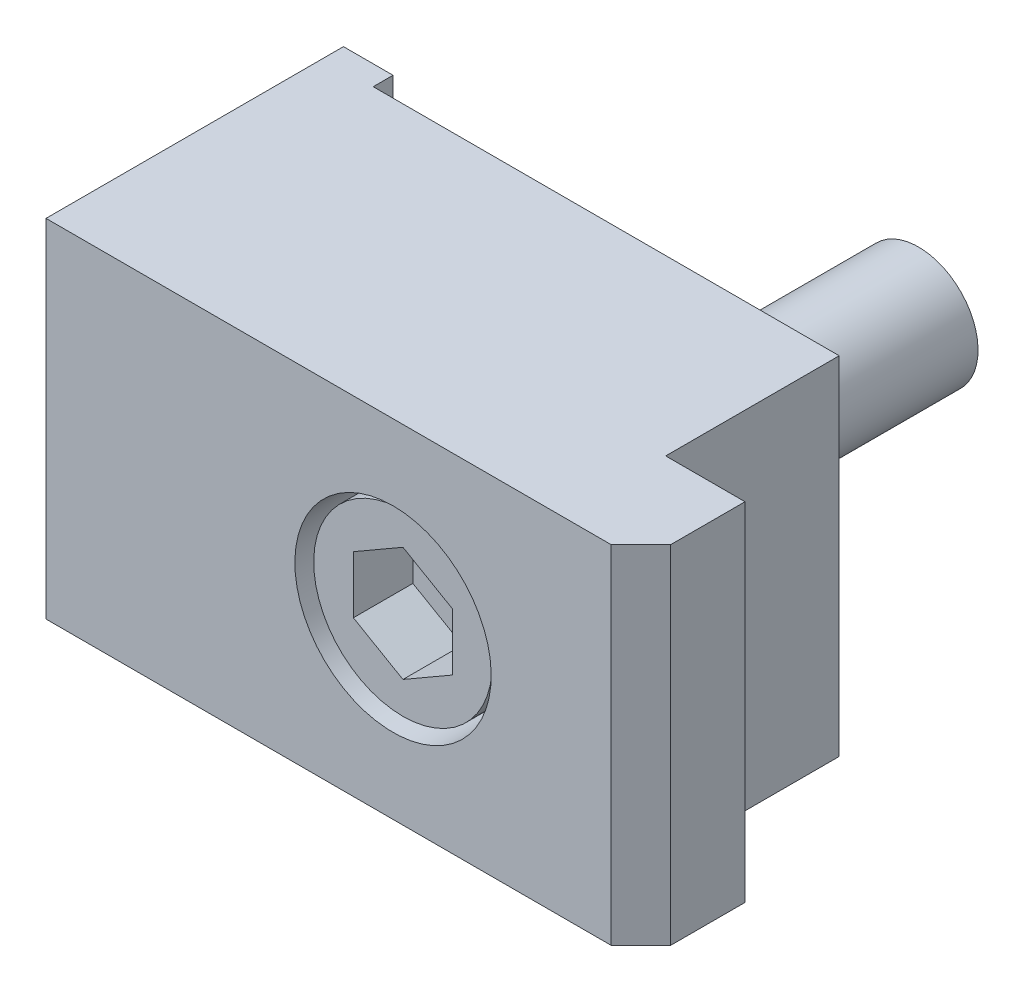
ISO-10303-21;
HEADER;
FILE_DESCRIPTION(('STEP AP214'),'2;1');
FILE_NAME('part.step','',(''),(''),'','','');
FILE_SCHEMA(('AUTOMOTIVE_DESIGN { 1 0 10303 214 1 1 1 1 }'));
ENDSEC;
DATA;
#1=APPLICATION_CONTEXT('core data for automotive mechanical design processes');
#2=APPLICATION_PROTOCOL_DEFINITION('international standard','automotive_design',2000,#1);
#3=PRODUCT_CONTEXT('',#1,'mechanical');
#4=PRODUCT('Part','Part','',(#3));
#5=PRODUCT_RELATED_PRODUCT_CATEGORY('part','',(#4));
#6=PRODUCT_DEFINITION_FORMATION('','',#4);
#7=PRODUCT_DEFINITION_CONTEXT('part definition',#1,'design');
#8=PRODUCT_DEFINITION('design','',#6,#7);
#9=PRODUCT_DEFINITION_SHAPE('','',#8);
#10=(LENGTH_UNIT() NAMED_UNIT(*) SI_UNIT(.MILLI.,.METRE.));
#11=(NAMED_UNIT(*) PLANE_ANGLE_UNIT() SI_UNIT($,.RADIAN.));
#12=(NAMED_UNIT(*) SI_UNIT($,.STERADIAN.) SOLID_ANGLE_UNIT());
#13=UNCERTAINTY_MEASURE_WITH_UNIT(LENGTH_MEASURE(1.E-05),#10,'distance_accuracy_value','');
#14=(GEOMETRIC_REPRESENTATION_CONTEXT(3) GLOBAL_UNCERTAINTY_ASSIGNED_CONTEXT((#13)) GLOBAL_UNIT_ASSIGNED_CONTEXT((#10,
#11,#12)) REPRESENTATION_CONTEXT('',''));
#15=CARTESIAN_POINT('',(0.,0.,0.));
#16=DIRECTION('',(0.,0.,1.));
#17=DIRECTION('',(1.,0.,0.));
#18=AXIS2_PLACEMENT_3D('',#15,#16,#17);
#19=CARTESIAN_POINT('',(-5.,-2.88675134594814,23.));
#20=DIRECTION('',(0.,0.,-1.));
#21=DIRECTION('',(0.,1.,0.));
#22=AXIS2_PLACEMENT_3D('',#19,#20,#21);
#23=PLANE('',#22);
#24=DIRECTION('',(0.866025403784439,-0.5,0.));
#25=VECTOR('',#24,1.);
#26=CARTESIAN_POINT('',(-5.,-2.88675134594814,23.));
#27=LINE('',#26,#25);
#28=CARTESIAN_POINT('',(-5.,-2.88675134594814,23.));
#29=VERTEX_POINT('',#28);
#30=CARTESIAN_POINT('',(0.,-5.77350269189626,23.));
#31=VERTEX_POINT('',#30);
#32=EDGE_CURVE('E260',#29,#31,#27,.T.);
#33=ORIENTED_EDGE('',*,*,#32,.T.);
#34=DIRECTION('',(0.866025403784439,0.5,0.));
#35=VECTOR('',#34,1.);
#36=CARTESIAN_POINT('',(0.,-5.77350269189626,23.));
#37=LINE('',#36,#35);
#38=CARTESIAN_POINT('',(5.,-2.88675134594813,23.));
#39=VERTEX_POINT('',#38);
#40=EDGE_CURVE('E262',#31,#39,#37,.T.);
#41=ORIENTED_EDGE('',*,*,#40,.T.);
#42=DIRECTION('',(0.,1.,0.));
#43=VECTOR('',#42,1.);
#44=CARTESIAN_POINT('',(5.,-2.88675134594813,23.));
#45=LINE('',#44,#43);
#46=CARTESIAN_POINT('',(5.,2.88675134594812,23.));
#47=VERTEX_POINT('',#46);
#48=EDGE_CURVE('E265',#39,#47,#45,.T.);
#49=ORIENTED_EDGE('',*,*,#48,.T.);
#50=DIRECTION('',(-0.866025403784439,0.5,0.));
#51=VECTOR('',#50,1.);
#52=CARTESIAN_POINT('',(5.,2.88675134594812,23.));
#53=LINE('',#52,#51);
#54=CARTESIAN_POINT('',(0.,5.77350269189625,23.));
#55=VERTEX_POINT('',#54);
#56=EDGE_CURVE('E154',#47,#55,#53,.T.);
#57=ORIENTED_EDGE('',*,*,#56,.T.);
#58=DIRECTION('',(-0.866025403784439,-0.5,0.));
#59=VECTOR('',#58,1.);
#60=CARTESIAN_POINT('',(0.,5.77350269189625,23.));
#61=LINE('',#60,#59);
#62=CARTESIAN_POINT('',(-5.,2.88675134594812,23.));
#63=VERTEX_POINT('',#62);
#64=EDGE_CURVE('E137',#55,#63,#61,.T.);
#65=ORIENTED_EDGE('',*,*,#64,.T.);
#66=DIRECTION('',(0.,-1.,0.));
#67=VECTOR('',#66,1.);
#68=CARTESIAN_POINT('',(-5.,2.88675134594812,23.));
#69=LINE('',#68,#67);
#70=EDGE_CURVE('E151',#63,#29,#69,.T.);
#71=ORIENTED_EDGE('',*,*,#70,.T.);
#72=EDGE_LOOP('',(#33,#41,#49,#57,#65,#71));
#73=FACE_BOUND('',#72,.T.);
#74=ADVANCED_FACE('F14',(#73),#23,.F.);
#75=CARTESIAN_POINT('',(0.,-5.77350269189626,23.));
#76=DIRECTION('',(0.5,-0.866025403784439,0.));
#77=DIRECTION('',(0.866025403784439,0.5,0.));
#78=AXIS2_PLACEMENT_3D('',#75,#76,#77);
#79=PLANE('',#78);
#80=DIRECTION('',(0.866025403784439,0.5,0.));
#81=VECTOR('',#80,1.);
#82=CARTESIAN_POINT('',(0.,-5.77350269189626,29.));
#83=LINE('',#82,#81);
#84=CARTESIAN_POINT('',(0.,-5.77350269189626,29.));
#85=VERTEX_POINT('',#84);
#86=CARTESIAN_POINT('',(5.,-2.88675134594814,29.));
#87=VERTEX_POINT('',#86);
#88=EDGE_CURVE('E248',#85,#87,#83,.T.);
#89=ORIENTED_EDGE('',*,*,#88,.T.);
#90=DIRECTION('',(0.,0.,1.));
#91=VECTOR('',#90,1.);
#92=CARTESIAN_POINT('',(5.,-2.88675134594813,23.));
#93=LINE('',#92,#91);
#94=EDGE_CURVE('E108',#39,#87,#93,.T.);
#95=ORIENTED_EDGE('',*,*,#94,.F.);
#96=ORIENTED_EDGE('',*,*,#40,.F.);
#97=DIRECTION('',(0.,0.,1.));
#98=VECTOR('',#97,1.);
#99=CARTESIAN_POINT('',(0.,-5.77350269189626,23.));
#100=LINE('',#99,#98);
#101=EDGE_CURVE('E158',#31,#85,#100,.T.);
#102=ORIENTED_EDGE('',*,*,#101,.T.);
#103=EDGE_LOOP('',(#89,#95,#96,#102));
#104=FACE_BOUND('',#103,.T.);
#105=ADVANCED_FACE('F277',(#104),#79,.F.);
#106=CARTESIAN_POINT('',(5.,-2.88675134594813,23.));
#107=DIRECTION('',(1.,0.,0.));
#108=DIRECTION('',(0.,1.,0.));
#109=AXIS2_PLACEMENT_3D('',#106,#107,#108);
#110=PLANE('',#109);
#111=DIRECTION('',(0.,1.,0.));
#112=VECTOR('',#111,1.);
#113=CARTESIAN_POINT('',(5.,-2.88675134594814,29.));
#114=LINE('',#113,#112);
#115=CARTESIAN_POINT('',(5.,2.88675134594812,29.));
#116=VERTEX_POINT('',#115);
#117=EDGE_CURVE('E250',#87,#116,#114,.T.);
#118=ORIENTED_EDGE('',*,*,#117,.T.);
#119=DIRECTION('',(0.,0.,1.));
#120=VECTOR('',#119,1.);
#121=CARTESIAN_POINT('',(5.,2.88675134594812,23.));
#122=LINE('',#121,#120);
#123=EDGE_CURVE('E166',#47,#116,#122,.T.);
#124=ORIENTED_EDGE('',*,*,#123,.F.);
#125=ORIENTED_EDGE('',*,*,#48,.F.);
#126=ORIENTED_EDGE('',*,*,#94,.T.);
#127=EDGE_LOOP('',(#118,#124,#125,#126));
#128=FACE_BOUND('',#127,.T.);
#129=ADVANCED_FACE('F267',(#128),#110,.F.);
#130=CARTESIAN_POINT('',(5.,2.88675134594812,23.));
#131=DIRECTION('',(0.5,0.866025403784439,0.));
#132=DIRECTION('',(-0.866025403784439,0.5,0.));
#133=AXIS2_PLACEMENT_3D('',#130,#131,#132);
#134=PLANE('',#133);
#135=DIRECTION('',(-0.866025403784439,0.5,0.));
#136=VECTOR('',#135,1.);
#137=CARTESIAN_POINT('',(5.,2.88675134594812,29.));
#138=LINE('',#137,#136);
#139=CARTESIAN_POINT('',(0.,5.77350269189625,29.));
#140=VERTEX_POINT('',#139);
#141=EDGE_CURVE('E254',#116,#140,#138,.T.);
#142=ORIENTED_EDGE('',*,*,#141,.T.);
#143=DIRECTION('',(0.,0.,1.));
#144=VECTOR('',#143,1.);
#145=CARTESIAN_POINT('',(0.,5.77350269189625,23.));
#146=LINE('',#145,#144);
#147=EDGE_CURVE('E146',#55,#140,#146,.T.);
#148=ORIENTED_EDGE('',*,*,#147,.F.);
#149=ORIENTED_EDGE('',*,*,#56,.F.);
#150=ORIENTED_EDGE('',*,*,#123,.T.);
#151=EDGE_LOOP('',(#142,#148,#149,#150));
#152=FACE_BOUND('',#151,.T.);
#153=ADVANCED_FACE('F271',(#152),#134,.F.);
#154=CARTESIAN_POINT('',(0.,5.77350269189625,23.));
#155=DIRECTION('',(-0.5,0.866025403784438,0.));
#156=DIRECTION('',(-0.866025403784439,-0.5,0.));
#157=AXIS2_PLACEMENT_3D('',#154,#155,#156);
#158=PLANE('',#157);
#159=DIRECTION('',(-0.866025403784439,-0.5,0.));
#160=VECTOR('',#159,1.);
#161=CARTESIAN_POINT('',(0.,5.77350269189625,29.));
#162=LINE('',#161,#160);
#163=CARTESIAN_POINT('',(-5.,2.88675134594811,29.));
#164=VERTEX_POINT('',#163);
#165=EDGE_CURVE('E140',#140,#164,#162,.T.);
#166=ORIENTED_EDGE('',*,*,#165,.T.);
#167=DIRECTION('',(0.,0.,1.));
#168=VECTOR('',#167,1.);
#169=CARTESIAN_POINT('',(-5.,2.88675134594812,23.));
#170=LINE('',#169,#168);
#171=EDGE_CURVE('E134',#63,#164,#170,.T.);
#172=ORIENTED_EDGE('',*,*,#171,.F.);
#173=ORIENTED_EDGE('',*,*,#64,.F.);
#174=ORIENTED_EDGE('',*,*,#147,.T.);
#175=EDGE_LOOP('',(#166,#172,#173,#174));
#176=FACE_BOUND('',#175,.T.);
#177=ADVANCED_FACE('F136',(#176),#158,.F.);
#178=CARTESIAN_POINT('',(-5.,2.88675134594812,23.));
#179=DIRECTION('',(-1.,0.,0.));
#180=DIRECTION('',(0.,0.,-1.));
#181=AXIS2_PLACEMENT_3D('',#178,#179,#180);
#182=PLANE('',#181);
#183=DIRECTION('',(0.,-1.,0.));
#184=VECTOR('',#183,1.);
#185=CARTESIAN_POINT('',(-5.,2.88675134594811,29.));
#186=LINE('',#185,#184);
#187=CARTESIAN_POINT('',(-5.,-2.88675134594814,29.));
#188=VERTEX_POINT('',#187);
#189=EDGE_CURVE('E258',#164,#188,#186,.T.);
#190=ORIENTED_EDGE('',*,*,#189,.T.);
#191=DIRECTION('',(0.,0.,1.));
#192=VECTOR('',#191,1.);
#193=CARTESIAN_POINT('',(-5.,-2.88675134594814,23.));
#194=LINE('',#193,#192);
#195=EDGE_CURVE('E145',#29,#188,#194,.T.);
#196=ORIENTED_EDGE('',*,*,#195,.F.);
#197=ORIENTED_EDGE('',*,*,#70,.F.);
#198=ORIENTED_EDGE('',*,*,#171,.T.);
#199=EDGE_LOOP('',(#190,#196,#197,#198));
#200=FACE_BOUND('',#199,.T.);
#201=ADVANCED_FACE('F156',(#200),#182,.F.);
#202=CARTESIAN_POINT('',(-5.,-2.88675134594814,23.));
#203=DIRECTION('',(-0.5,-0.866025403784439,0.));
#204=DIRECTION('',(0.866025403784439,-0.5,0.));
#205=AXIS2_PLACEMENT_3D('',#202,#203,#204);
#206=PLANE('',#205);
#207=DIRECTION('',(0.866025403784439,-0.5,0.));
#208=VECTOR('',#207,1.);
#209=CARTESIAN_POINT('',(-5.,-2.88675134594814,29.));
#210=LINE('',#209,#208);
#211=EDGE_CURVE('E33',#188,#85,#210,.T.);
#212=ORIENTED_EDGE('',*,*,#211,.T.);
#213=ORIENTED_EDGE('',*,*,#101,.F.);
#214=ORIENTED_EDGE('',*,*,#32,.F.);
#215=ORIENTED_EDGE('',*,*,#195,.T.);
#216=EDGE_LOOP('',(#212,#213,#214,#215));
#217=FACE_BOUND('',#216,.T.);
#218=ADVANCED_FACE('F278',(#217),#206,.F.);
#219=CARTESIAN_POINT('',(0.,0.,29.));
#220=DIRECTION('',(0.,0.,1.));
#221=DIRECTION('',(0.,-1.,0.));
#222=AXIS2_PLACEMENT_3D('',#219,#220,#221);
#223=PLANE('',#222);
#224=ORIENTED_EDGE('',*,*,#211,.F.);
#225=ORIENTED_EDGE('',*,*,#189,.F.);
#226=ORIENTED_EDGE('',*,*,#165,.F.);
#227=ORIENTED_EDGE('',*,*,#141,.F.);
#228=ORIENTED_EDGE('',*,*,#117,.F.);
#229=ORIENTED_EDGE('',*,*,#88,.F.);
#230=EDGE_LOOP('',(#224,#225,#226,#227,#228,#229));
#231=FACE_BOUND('',#230,.T.);
#232=CARTESIAN_POINT('',(0.,0.,29.));
#233=DIRECTION('',(0.,0.,1.));
#234=DIRECTION('',(0.,-1.,0.));
#235=AXIS2_PLACEMENT_3D('',#232,#233,#234);
#236=CIRCLE('',#235,9.);
#237=CARTESIAN_POINT('',(0.,-9.,29.));
#238=VERTEX_POINT('',#237);
#239=EDGE_CURVE('E171',#238,#238,#236,.T.);
#240=ORIENTED_EDGE('',*,*,#239,.T.);
#241=EDGE_LOOP('',(#240));
#242=FACE_BOUND('',#241,.T.);
#243=ADVANCED_FACE('F273',(#231,#242),#223,.T.);
#244=CARTESIAN_POINT('',(0.,0.,29.));
#245=DIRECTION('',(0.,0.,-1.));
#246=DIRECTION('',(0.,1.,0.));
#247=AXIS2_PLACEMENT_3D('',#244,#245,#246);
#248=CYLINDRICAL_SURFACE('',#247,9.);
#249=ORIENTED_EDGE('',*,*,#239,.F.);
#250=EDGE_LOOP('',(#249));
#251=FACE_BOUND('',#250,.T.);
#252=CARTESIAN_POINT('',(0.,0.,17.));
#253=DIRECTION('',(0.,0.,1.));
#254=DIRECTION('',(0.,-1.,0.));
#255=AXIS2_PLACEMENT_3D('',#252,#253,#254);
#256=CIRCLE('',#255,9.);
#257=CARTESIAN_POINT('',(0.,-9.,17.));
#258=VERTEX_POINT('',#257);
#259=EDGE_CURVE('E163',#258,#258,#256,.T.);
#260=ORIENTED_EDGE('',*,*,#259,.T.);
#261=EDGE_LOOP('',(#260));
#262=FACE_BOUND('',#261,.T.);
#263=ADVANCED_FACE('F287',(#251,#262),#248,.T.);
#264=CARTESIAN_POINT('',(0.,0.,17.));
#265=DIRECTION('',(0.,0.,1.));
#266=DIRECTION('',(0.,-1.,0.));
#267=AXIS2_PLACEMENT_3D('',#264,#265,#266);
#268=PLANE('',#267);
#269=CARTESIAN_POINT('',(0.,0.,17.));
#270=DIRECTION('',(0.,0.,1.));
#271=DIRECTION('',(0.,-1.,0.));
#272=AXIS2_PLACEMENT_3D('',#269,#270,#271);
#273=CIRCLE('',#272,6.);
#274=CARTESIAN_POINT('',(0.,-6.,17.));
#275=VERTEX_POINT('',#274);
#276=EDGE_CURVE('E24',#275,#275,#273,.T.);
#277=ORIENTED_EDGE('',*,*,#276,.T.);
#278=EDGE_LOOP('',(#277));
#279=FACE_BOUND('',#278,.T.);
#280=CARTESIAN_POINT('',(0.,0.,17.));
#281=DIRECTION('',(0.,0.,1.));
#282=DIRECTION('',(0.,-1.,0.));
#283=AXIS2_PLACEMENT_3D('',#280,#281,#282);
#284=CIRCLE('',#283,7.);
#285=CARTESIAN_POINT('',(0.,-7.,17.));
#286=VERTEX_POINT('',#285);
#287=EDGE_CURVE('E9',#286,#286,#284,.T.);
#288=ORIENTED_EDGE('',*,*,#287,.F.);
#289=EDGE_LOOP('',(#288));
#290=FACE_BOUND('',#289,.T.);
#291=ADVANCED_FACE('F359',(#279,#290),#268,.F.);
#292=CARTESIAN_POINT('',(0.,0.,17.));
#293=DIRECTION('',(0.,0.,-1.));
#294=DIRECTION('',(0.,1.,0.));
#295=AXIS2_PLACEMENT_3D('',#292,#293,#294);
#296=CYLINDRICAL_SURFACE('',#295,6.);
#297=ORIENTED_EDGE('',*,*,#276,.F.);
#298=EDGE_LOOP('',(#297));
#299=FACE_BOUND('',#298,.T.);
#300=CARTESIAN_POINT('',(0.,0.,-23.));
#301=DIRECTION('',(0.,0.,1.));
#302=DIRECTION('',(0.,-1.,0.));
#303=AXIS2_PLACEMENT_3D('',#300,#301,#302);
#304=CIRCLE('',#303,6.);
#305=CARTESIAN_POINT('',(0.,-6.,-23.));
#306=VERTEX_POINT('',#305);
#307=EDGE_CURVE('E174',#306,#306,#304,.T.);
#308=ORIENTED_EDGE('',*,*,#307,.T.);
#309=EDGE_LOOP('',(#308));
#310=FACE_BOUND('',#309,.T.);
#311=ADVANCED_FACE('F367',(#299,#310),#296,.T.);
#312=CARTESIAN_POINT('',(0.,0.,-23.));
#313=DIRECTION('',(0.,0.,1.));
#314=DIRECTION('',(0.,-1.,0.));
#315=AXIS2_PLACEMENT_3D('',#312,#313,#314);
#316=PLANE('',#315);
#317=ORIENTED_EDGE('',*,*,#307,.F.);
#318=EDGE_LOOP('',(#317));
#319=FACE_BOUND('',#318,.T.);
#320=ADVANCED_FACE('F376',(#319),#316,.F.);
#321=CARTESIAN_POINT('',(17.,17.5,19.5));
#322=DIRECTION('',(0.,0.,1.));
#323=DIRECTION('',(0.,1.,0.));
#324=AXIS2_PLACEMENT_3D('',#321,#322,#323);
#325=PLANE('',#324);
#326=DIRECTION('',(-1.,0.,0.));
#327=VECTOR('',#326,1.);
#328=CARTESIAN_POINT('',(17.,-17.5,19.5));
#329=LINE('',#328,#327);
#330=CARTESIAN_POINT('',(25.,-17.5,19.5));
#331=VERTEX_POINT('',#330);
#332=CARTESIAN_POINT('',(17.,-17.5,19.5));
#333=VERTEX_POINT('',#332);
#334=EDGE_CURVE('E200',#331,#333,#329,.T.);
#335=ORIENTED_EDGE('',*,*,#334,.T.);
#336=DIRECTION('',(0.,-1.,0.));
#337=VECTOR('',#336,1.);
#338=CARTESIAN_POINT('',(17.,17.5,19.5));
#339=LINE('',#338,#337);
#340=CARTESIAN_POINT('',(17.,17.5,19.5));
#341=VERTEX_POINT('',#340);
#342=EDGE_CURVE('E219',#341,#333,#339,.T.);
#343=ORIENTED_EDGE('',*,*,#342,.F.);
#344=DIRECTION('',(-1.,0.,0.));
#345=VECTOR('',#344,1.);
#346=CARTESIAN_POINT('',(17.,17.5,19.5));
#347=LINE('',#346,#345);
#348=CARTESIAN_POINT('',(25.,17.5,19.5));
#349=VERTEX_POINT('',#348);
#350=EDGE_CURVE('E217',#349,#341,#347,.T.);
#351=ORIENTED_EDGE('',*,*,#350,.F.);
#352=DIRECTION('',(0.,-1.,0.));
#353=VECTOR('',#352,1.);
#354=CARTESIAN_POINT('',(25.,17.5,19.5));
#355=LINE('',#354,#353);
#356=EDGE_CURVE('E222',#349,#331,#355,.T.);
#357=ORIENTED_EDGE('',*,*,#356,.T.);
#358=EDGE_LOOP('',(#335,#343,#351,#357));
#359=FACE_BOUND('',#358,.T.);
#360=ADVANCED_FACE('F385',(#359),#325,.F.);
#361=CARTESIAN_POINT('',(-30.,17.5,0.));
#362=DIRECTION('',(0.,0.,1.));
#363=DIRECTION('',(1.,0.,0.));
#364=AXIS2_PLACEMENT_3D('',#361,#362,#363);
#365=PLANE('',#364);
#366=DIRECTION('',(-1.,0.,0.));
#367=VECTOR('',#366,1.);
#368=CARTESIAN_POINT('',(-30.,-17.5,0.));
#369=LINE('',#368,#367);
#370=CARTESIAN_POINT('',(-30.,-17.5,0.));
#371=VERTEX_POINT('',#370);
#372=CARTESIAN_POINT('',(-35.,-17.5,0.));
#373=VERTEX_POINT('',#372);
#374=EDGE_CURVE('E192',#371,#373,#369,.T.);
#375=ORIENTED_EDGE('',*,*,#374,.T.);
#376=DIRECTION('',(0.,-1.,0.));
#377=VECTOR('',#376,1.);
#378=CARTESIAN_POINT('',(-35.,17.5,0.));
#379=LINE('',#378,#377);
#380=CARTESIAN_POINT('',(-35.,17.5,0.));
#381=VERTEX_POINT('',#380);
#382=EDGE_CURVE('E228',#381,#373,#379,.T.);
#383=ORIENTED_EDGE('',*,*,#382,.F.);
#384=DIRECTION('',(-1.,0.,0.));
#385=VECTOR('',#384,1.);
#386=CARTESIAN_POINT('',(-30.,17.5,0.));
#387=LINE('',#386,#385);
#388=CARTESIAN_POINT('',(-30.,17.5,0.));
#389=VERTEX_POINT('',#388);
#390=EDGE_CURVE('E209',#389,#381,#387,.T.);
#391=ORIENTED_EDGE('',*,*,#390,.F.);
#392=DIRECTION('',(0.,-1.,0.));
#393=VECTOR('',#392,1.);
#394=CARTESIAN_POINT('',(-30.,17.5,0.));
#395=LINE('',#394,#393);
#396=EDGE_CURVE('E231',#389,#371,#395,.T.);
#397=ORIENTED_EDGE('',*,*,#396,.T.);
#398=EDGE_LOOP('',(#375,#383,#391,#397));
#399=FACE_BOUND('',#398,.T.);
#400=ADVANCED_FACE('F394',(#399),#365,.F.);
#401=CARTESIAN_POINT('',(25.,17.5,19.5));
#402=DIRECTION('',(-1.,0.,0.));
#403=DIRECTION('',(0.,-1.,0.));
#404=AXIS2_PLACEMENT_3D('',#401,#402,#403);
#405=PLANE('',#404);
#406=DIRECTION('',(0.,0.,-1.));
#407=VECTOR('',#406,1.);
#408=CARTESIAN_POINT('',(25.,17.5,19.5));
#409=LINE('',#408,#407);
#410=CARTESIAN_POINT('',(25.,17.5,27.));
#411=VERTEX_POINT('',#410);
#412=EDGE_CURVE('E215',#411,#349,#409,.T.);
#413=ORIENTED_EDGE('',*,*,#412,.F.);
#414=DIRECTION('',(0.,-1.,0.));
#415=VECTOR('',#414,1.);
#416=CARTESIAN_POINT('',(25.,17.5,27.));
#417=LINE('',#416,#415);
#418=CARTESIAN_POINT('',(25.,-17.5,27.));
#419=VERTEX_POINT('',#418);
#420=EDGE_CURVE('E240',#411,#419,#417,.T.);
#421=ORIENTED_EDGE('',*,*,#420,.T.);
#422=DIRECTION('',(0.,0.,-1.));
#423=VECTOR('',#422,1.);
#424=CARTESIAN_POINT('',(25.,-17.5,19.5));
#425=LINE('',#424,#423);
#426=EDGE_CURVE('E198',#419,#331,#425,.T.);
#427=ORIENTED_EDGE('',*,*,#426,.T.);
#428=ORIENTED_EDGE('',*,*,#356,.F.);
#429=EDGE_LOOP('',(#413,#421,#427,#428));
#430=FACE_BOUND('',#429,.T.);
#431=ADVANCED_FACE('F398',(#430),#405,.F.);
#432=CARTESIAN_POINT('',(-35.,17.5,30.));
#433=DIRECTION('',(1.,0.,0.));
#434=DIRECTION('',(0.,0.,-1.));
#435=AXIS2_PLACEMENT_3D('',#432,#433,#434);
#436=PLANE('',#435);
#437=DIRECTION('',(0.,0.,1.));
#438=VECTOR('',#437,1.);
#439=CARTESIAN_POINT('',(-35.,-17.5,30.));
#440=LINE('',#439,#438);
#441=CARTESIAN_POINT('',(-35.,-17.5,30.));
#442=VERTEX_POINT('',#441);
#443=EDGE_CURVE('E194',#373,#442,#440,.T.);
#444=ORIENTED_EDGE('',*,*,#443,.T.);
#445=DIRECTION('',(0.,-1.,0.));
#446=VECTOR('',#445,1.);
#447=CARTESIAN_POINT('',(-35.,17.5,30.));
#448=LINE('',#447,#446);
#449=CARTESIAN_POINT('',(-35.,17.5,30.));
#450=VERTEX_POINT('',#449);
#451=EDGE_CURVE('E225',#450,#442,#448,.T.);
#452=ORIENTED_EDGE('',*,*,#451,.F.);
#453=DIRECTION('',(0.,0.,1.));
#454=VECTOR('',#453,1.);
#455=CARTESIAN_POINT('',(-35.,17.5,30.));
#456=LINE('',#455,#454);
#457=EDGE_CURVE('E211',#381,#450,#456,.T.);
#458=ORIENTED_EDGE('',*,*,#457,.F.);
#459=ORIENTED_EDGE('',*,*,#382,.T.);
#460=EDGE_LOOP('',(#444,#452,#458,#459));
#461=FACE_BOUND('',#460,.T.);
#462=ADVANCED_FACE('F407',(#461),#436,.F.);
#463=CARTESIAN_POINT('',(25.,17.5,27.));
#464=DIRECTION('',(-0.707106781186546,0.,-0.707106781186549));
#465=DIRECTION('',(-0.707106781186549,0.,0.707106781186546));
#466=AXIS2_PLACEMENT_3D('',#463,#464,#465);
#467=PLANE('',#466);
#468=DIRECTION('',(-0.707106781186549,0.,0.707106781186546));
#469=VECTOR('',#468,1.);
#470=CARTESIAN_POINT('',(24.75,17.5,27.25));
#471=LINE('',#470,#469);
#472=CARTESIAN_POINT('',(22.,17.5,30.));
#473=VERTEX_POINT('',#472);
#474=EDGE_CURVE('E244',#473,#411,#471,.F.);
#475=ORIENTED_EDGE('',*,*,#474,.F.);
#476=DIRECTION('',(0.,1.,0.));
#477=VECTOR('',#476,1.);
#478=CARTESIAN_POINT('',(22.,17.5,30.));
#479=LINE('',#478,#477);
#480=CARTESIAN_POINT('',(22.,-17.5,30.));
#481=VERTEX_POINT('',#480);
#482=EDGE_CURVE('E99',#481,#473,#479,.T.);
#483=ORIENTED_EDGE('',*,*,#482,.F.);
#484=DIRECTION('',(0.707106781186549,0.,-0.707106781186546));
#485=VECTOR('',#484,1.);
#486=CARTESIAN_POINT('',(25.,-17.5,27.));
#487=LINE('',#486,#485);
#488=EDGE_CURVE('E92',#419,#481,#487,.F.);
#489=ORIENTED_EDGE('',*,*,#488,.F.);
#490=ORIENTED_EDGE('',*,*,#420,.F.);
#491=EDGE_LOOP('',(#475,#483,#489,#490));
#492=FACE_BOUND('',#491,.T.);
#493=ADVANCED_FACE('F424',(#492),#467,.F.);
#494=CARTESIAN_POINT('',(17.,17.5,2.));
#495=DIRECTION('',(-1.,0.,0.));
#496=DIRECTION('',(0.,-1.,0.));
#497=AXIS2_PLACEMENT_3D('',#494,#495,#496);
#498=PLANE('',#497);
#499=DIRECTION('',(0.,0.,-1.));
#500=VECTOR('',#499,1.);
#501=CARTESIAN_POINT('',(17.,-17.5,2.));
#502=LINE('',#501,#500);
#503=CARTESIAN_POINT('',(17.,-17.5,2.));
#504=VERTEX_POINT('',#503);
#505=EDGE_CURVE('E185',#333,#504,#502,.T.);
#506=ORIENTED_EDGE('',*,*,#505,.T.);
#507=DIRECTION('',(0.,-1.,0.));
#508=VECTOR('',#507,1.);
#509=CARTESIAN_POINT('',(17.,17.5,2.));
#510=LINE('',#509,#508);
#511=CARTESIAN_POINT('',(17.,17.5,2.));
#512=VERTEX_POINT('',#511);
#513=EDGE_CURVE('E237',#512,#504,#510,.T.);
#514=ORIENTED_EDGE('',*,*,#513,.F.);
#515=DIRECTION('',(0.,0.,-1.));
#516=VECTOR('',#515,1.);
#517=CARTESIAN_POINT('',(17.,17.5,2.));
#518=LINE('',#517,#516);
#519=EDGE_CURVE('E202',#341,#512,#518,.T.);
#520=ORIENTED_EDGE('',*,*,#519,.F.);
#521=ORIENTED_EDGE('',*,*,#342,.T.);
#522=EDGE_LOOP('',(#506,#514,#520,#521));
#523=FACE_BOUND('',#522,.T.);
#524=ADVANCED_FACE('F16',(#523),#498,.F.);
#525=CARTESIAN_POINT('',(17.,17.5,19.5));
#526=DIRECTION('',(0.,1.,0.));
#527=DIRECTION('',(-1.,0.,0.));
#528=AXIS2_PLACEMENT_3D('',#525,#526,#527);
#529=PLANE('',#528);
#530=DIRECTION('',(1.,0.,0.));
#531=VECTOR('',#530,1.);
#532=CARTESIAN_POINT('',(25.,17.5,30.));
#533=LINE('',#532,#531);
#534=EDGE_CURVE('E213',#450,#473,#533,.T.);
#535=ORIENTED_EDGE('',*,*,#534,.T.);
#536=ORIENTED_EDGE('',*,*,#474,.T.);
#537=ORIENTED_EDGE('',*,*,#412,.T.);
#538=ORIENTED_EDGE('',*,*,#350,.T.);
#539=ORIENTED_EDGE('',*,*,#519,.T.);
#540=DIRECTION('',(-1.,0.,0.));
#541=VECTOR('',#540,1.);
#542=CARTESIAN_POINT('',(17.,17.5,2.));
#543=LINE('',#542,#541);
#544=CARTESIAN_POINT('',(-30.,17.5,2.));
#545=VERTEX_POINT('',#544);
#546=EDGE_CURVE('E205',#512,#545,#543,.T.);
#547=ORIENTED_EDGE('',*,*,#546,.T.);
#548=DIRECTION('',(0.,0.,-1.));
#549=VECTOR('',#548,1.);
#550=CARTESIAN_POINT('',(-30.,17.5,2.));
#551=LINE('',#550,#549);
#552=EDGE_CURVE('E207',#545,#389,#551,.T.);
#553=ORIENTED_EDGE('',*,*,#552,.T.);
#554=ORIENTED_EDGE('',*,*,#390,.T.);
#555=ORIENTED_EDGE('',*,*,#457,.T.);
#556=EDGE_LOOP('',(#535,#536,#537,#538,#539,#547,#553,#554,#555));
#557=FACE_BOUND('',#556,.T.);
#558=ADVANCED_FACE('F397',(#557),#529,.T.);
#559=CARTESIAN_POINT('',(-30.,17.5,2.));
#560=DIRECTION('',(-1.,0.,0.));
#561=DIRECTION('',(0.,-1.,0.));
#562=AXIS2_PLACEMENT_3D('',#559,#560,#561);
#563=PLANE('',#562);
#564=DIRECTION('',(0.,0.,-1.));
#565=VECTOR('',#564,1.);
#566=CARTESIAN_POINT('',(-30.,-17.5,2.));
#567=LINE('',#566,#565);
#568=CARTESIAN_POINT('',(-30.,-17.5,2.));
#569=VERTEX_POINT('',#568);
#570=EDGE_CURVE('E190',#569,#371,#567,.T.);
#571=ORIENTED_EDGE('',*,*,#570,.T.);
#572=ORIENTED_EDGE('',*,*,#396,.F.);
#573=ORIENTED_EDGE('',*,*,#552,.F.);
#574=DIRECTION('',(0.,-1.,0.));
#575=VECTOR('',#574,1.);
#576=CARTESIAN_POINT('',(-30.,17.5,2.));
#577=LINE('',#576,#575);
#578=EDGE_CURVE('E234',#545,#569,#577,.T.);
#579=ORIENTED_EDGE('',*,*,#578,.T.);
#580=EDGE_LOOP('',(#571,#572,#573,#579));
#581=FACE_BOUND('',#580,.T.);
#582=ADVANCED_FACE('F408',(#581),#563,.F.);
#583=CARTESIAN_POINT('',(17.,-17.5,19.5));
#584=DIRECTION('',(0.,1.,0.));
#585=DIRECTION('',(-1.,0.,0.));
#586=AXIS2_PLACEMENT_3D('',#583,#584,#585);
#587=PLANE('',#586);
#588=ORIENTED_EDGE('',*,*,#426,.F.);
#589=ORIENTED_EDGE('',*,*,#488,.T.);
#590=DIRECTION('',(1.,0.,0.));
#591=VECTOR('',#590,1.);
#592=CARTESIAN_POINT('',(25.,-17.5,30.));
#593=LINE('',#592,#591);
#594=EDGE_CURVE('E196',#442,#481,#593,.T.);
#595=ORIENTED_EDGE('',*,*,#594,.F.);
#596=ORIENTED_EDGE('',*,*,#443,.F.);
#597=ORIENTED_EDGE('',*,*,#374,.F.);
#598=ORIENTED_EDGE('',*,*,#570,.F.);
#599=DIRECTION('',(-1.,0.,0.));
#600=VECTOR('',#599,1.);
#601=CARTESIAN_POINT('',(17.,-17.5,2.));
#602=LINE('',#601,#600);
#603=EDGE_CURVE('E188',#504,#569,#602,.T.);
#604=ORIENTED_EDGE('',*,*,#603,.F.);
#605=ORIENTED_EDGE('',*,*,#505,.F.);
#606=ORIENTED_EDGE('',*,*,#334,.F.);
#607=EDGE_LOOP('',(#588,#589,#595,#596,#597,#598,#604,#605,#606));
#608=FACE_BOUND('',#607,.T.);
#609=ADVANCED_FACE('F436',(#608),#587,.F.);
#610=CARTESIAN_POINT('',(17.,17.5,2.));
#611=DIRECTION('',(0.,0.,1.));
#612=DIRECTION('',(0.,1.,0.));
#613=AXIS2_PLACEMENT_3D('',#610,#611,#612);
#614=PLANE('',#613);
#615=CARTESIAN_POINT('',(0.,0.,2.));
#616=DIRECTION('',(0.,0.,1.));
#617=DIRECTION('',(0.,1.,0.));
#618=AXIS2_PLACEMENT_3D('',#615,#616,#617);
#619=CIRCLE('',#618,7.);
#620=CARTESIAN_POINT('',(0.,7.,2.));
#621=VERTEX_POINT('',#620);
#622=EDGE_CURVE('E18',#621,#621,#619,.T.);
#623=ORIENTED_EDGE('',*,*,#622,.T.);
#624=EDGE_LOOP('',(#623));
#625=FACE_BOUND('',#624,.T.);
#626=ORIENTED_EDGE('',*,*,#603,.T.);
#627=ORIENTED_EDGE('',*,*,#578,.F.);
#628=ORIENTED_EDGE('',*,*,#546,.F.);
#629=ORIENTED_EDGE('',*,*,#513,.T.);
#630=EDGE_LOOP('',(#626,#627,#628,#629));
#631=FACE_BOUND('',#630,.T.);
#632=ADVANCED_FACE('F444',(#625,#631),#614,.F.);
#633=CARTESIAN_POINT('',(0.,0.,30.));
#634=DIRECTION('',(0.,0.,1.));
#635=DIRECTION('',(0.,1.,0.));
#636=AXIS2_PLACEMENT_3D('',#633,#634,#635);
#637=CYLINDRICAL_SURFACE('',#636,7.);
#638=ORIENTED_EDGE('',*,*,#287,.T.);
#639=EDGE_LOOP('',(#638));
#640=FACE_BOUND('',#639,.T.);
#641=ORIENTED_EDGE('',*,*,#622,.F.);
#642=EDGE_LOOP('',(#641));
#643=FACE_BOUND('',#642,.T.);
#644=ADVANCED_FACE('F435',(#640,#643),#637,.F.);
#645=CARTESIAN_POINT('',(25.,17.5,30.));
#646=DIRECTION('',(0.,0.,-1.));
#647=DIRECTION('',(0.,-1.,0.));
#648=AXIS2_PLACEMENT_3D('',#645,#646,#647);
#649=PLANE('',#648);
#650=CARTESIAN_POINT('',(0.,0.,30.));
#651=DIRECTION('',(0.,0.,1.));
#652=DIRECTION('',(0.,1.,0.));
#653=AXIS2_PLACEMENT_3D('',#650,#651,#652);
#654=CIRCLE('',#653,9.9);
#655=CARTESIAN_POINT('',(0.,9.9,30.));
#656=VERTEX_POINT('',#655);
#657=EDGE_CURVE('E182',#656,#656,#654,.T.);
#658=ORIENTED_EDGE('',*,*,#657,.F.);
#659=EDGE_LOOP('',(#658));
#660=FACE_BOUND('',#659,.T.);
#661=ORIENTED_EDGE('',*,*,#594,.T.);
#662=ORIENTED_EDGE('',*,*,#482,.T.);
#663=ORIENTED_EDGE('',*,*,#534,.F.);
#664=ORIENTED_EDGE('',*,*,#451,.T.);
#665=EDGE_LOOP('',(#661,#662,#663,#664));
#666=FACE_BOUND('',#665,.T.);
#667=ADVANCED_FACE('F417',(#660,#666),#649,.F.);
#668=CARTESIAN_POINT('',(0.,0.,30.));
#669=DIRECTION('',(0.,0.,1.));
#670=DIRECTION('',(0.,1.,0.));
#671=AXIS2_PLACEMENT_3D('',#668,#669,#670);
#672=CYLINDRICAL_SURFACE('',#671,9.9);
#673=CARTESIAN_POINT('',(0.,0.,17.));
#674=DIRECTION('',(0.,0.,1.));
#675=DIRECTION('',(0.,1.,0.));
#676=AXIS2_PLACEMENT_3D('',#673,#674,#675);
#677=CIRCLE('',#676,9.9);
#678=CARTESIAN_POINT('',(0.,9.9,17.));
#679=VERTEX_POINT('',#678);
#680=EDGE_CURVE('E179',#679,#679,#677,.T.);
#681=ORIENTED_EDGE('',*,*,#680,.F.);
#682=EDGE_LOOP('',(#681));
#683=FACE_BOUND('',#682,.T.);
#684=ORIENTED_EDGE('',*,*,#657,.T.);
#685=EDGE_LOOP('',(#684));
#686=FACE_BOUND('',#685,.T.);
#687=ADVANCED_FACE('F482',(#683,#686),#672,.F.);
#688=CARTESIAN_POINT('',(-7.,0.,17.));
#689=DIRECTION('',(0.,0.,-1.));
#690=DIRECTION('',(0.,-1.,0.));
#691=AXIS2_PLACEMENT_3D('',#688,#689,#690);
#692=PLANE('',#691);
#693=ORIENTED_EDGE('',*,*,#259,.F.);
#694=EDGE_LOOP('',(#693));
#695=FACE_BOUND('',#694,.T.);
#696=ORIENTED_EDGE('',*,*,#680,.T.);
#697=EDGE_LOOP('',(#696));
#698=FACE_BOUND('',#697,.T.);
#699=ADVANCED_FACE('F369',(#695,#698),#692,.F.);
#700=CLOSED_SHELL('',(#74,#105,#129,#153,#177,#201,#218,#243,#263,#291,#311,#320,#360,#400,#431,
#462,#493,#524,#558,#582,#609,#632,#644,#667,#687,#699));
#701=MANIFOLD_SOLID_BREP('B1',#700);
#702=ADVANCED_BREP_SHAPE_REPRESENTATION('',(#18,#701),#14);
#703=SHAPE_DEFINITION_REPRESENTATION(#9,#702);
ENDSEC;
END-ISO-10303-21;
